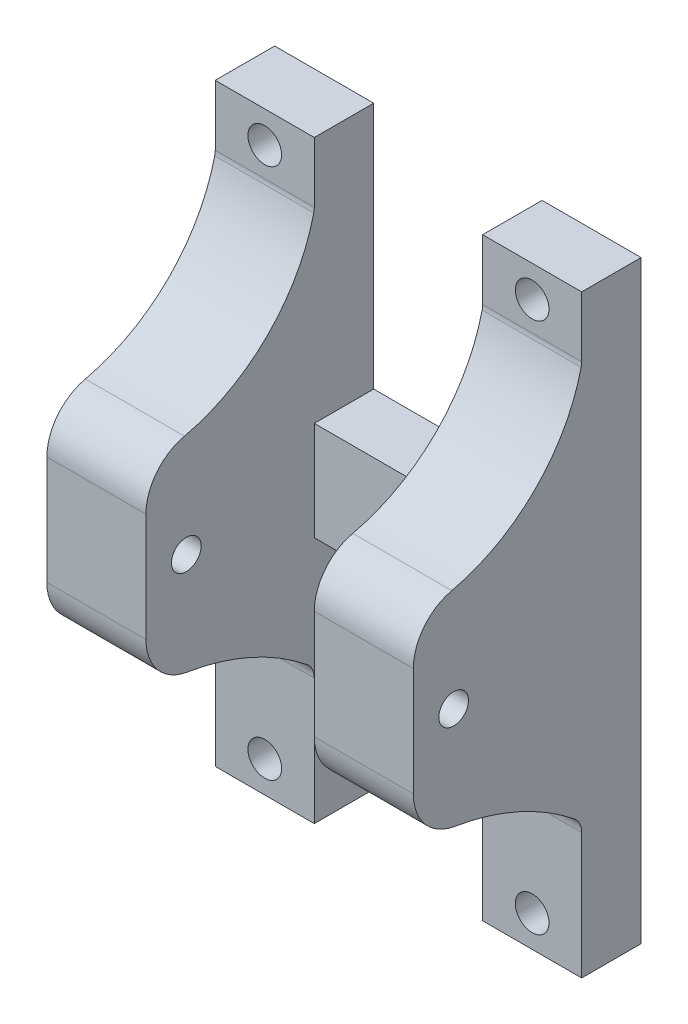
ISO-10303-21;
HEADER;
FILE_DESCRIPTION(('STEP AP214'),'2;1');
FILE_NAME('part.step','',(''),(''),'','','');
FILE_SCHEMA(('AUTOMOTIVE_DESIGN { 1 0 10303 214 1 1 1 1 }'));
ENDSEC;
DATA;
#1=APPLICATION_CONTEXT('core data for automotive mechanical design processes');
#2=APPLICATION_PROTOCOL_DEFINITION('international standard','automotive_design',2000,#1);
#3=PRODUCT_CONTEXT('',#1,'mechanical');
#4=PRODUCT('Part','Part','',(#3));
#5=PRODUCT_RELATED_PRODUCT_CATEGORY('part','',(#4));
#6=PRODUCT_DEFINITION_FORMATION('','',#4);
#7=PRODUCT_DEFINITION_CONTEXT('part definition',#1,'design');
#8=PRODUCT_DEFINITION('design','',#6,#7);
#9=PRODUCT_DEFINITION_SHAPE('','',#8);
#10=(LENGTH_UNIT() NAMED_UNIT(*) SI_UNIT(.MILLI.,.METRE.));
#11=(NAMED_UNIT(*) PLANE_ANGLE_UNIT() SI_UNIT($,.RADIAN.));
#12=(NAMED_UNIT(*) SI_UNIT($,.STERADIAN.) SOLID_ANGLE_UNIT());
#13=UNCERTAINTY_MEASURE_WITH_UNIT(LENGTH_MEASURE(1.E-05),#10,'distance_accuracy_value','');
#14=(GEOMETRIC_REPRESENTATION_CONTEXT(3) GLOBAL_UNCERTAINTY_ASSIGNED_CONTEXT((#13)) GLOBAL_UNIT_ASSIGNED_CONTEXT((#10,
#11,#12)) REPRESENTATION_CONTEXT('',''));
#15=CARTESIAN_POINT('',(0.,0.,0.));
#16=DIRECTION('',(0.,0.,1.));
#17=DIRECTION('',(1.,0.,0.));
#18=AXIS2_PLACEMENT_3D('',#15,#16,#17);
#19=CARTESIAN_POINT('',(0.,0.,6.));
#20=DIRECTION('',(0.,0.,1.));
#21=DIRECTION('',(1.,0.,0.));
#22=AXIS2_PLACEMENT_3D('',#19,#20,#21);
#23=PLANE('',#22);
#24=CARTESIAN_POINT('',(13.5,26.8316167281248,6.));
#25=DIRECTION('',(0.,0.,-1.));
#26=DIRECTION('',(-1.,0.,0.));
#27=AXIS2_PLACEMENT_3D('',#24,#25,#26);
#28=CIRCLE('',#27,1.7);
#29=CARTESIAN_POINT('',(11.8,26.8316167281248,6.));
#30=VERTEX_POINT('',#29);
#31=EDGE_CURVE('E270',#30,#30,#28,.T.);
#32=ORIENTED_EDGE('',*,*,#31,.T.);
#33=EDGE_LOOP('',(#32));
#34=FACE_BOUND('',#33,.T.);
#35=DIRECTION('',(0.,-1.,0.));
#36=VECTOR('',#35,1.);
#37=CARTESIAN_POINT('',(8.50000000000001,30.,6.));
#38=LINE('',#37,#36);
#39=CARTESIAN_POINT('',(8.50000000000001,30.,6.));
#40=VERTEX_POINT('',#39);
#41=CARTESIAN_POINT('',(8.50000000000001,23.8875951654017,6.));
#42=VERTEX_POINT('',#41);
#43=EDGE_CURVE('E229',#40,#42,#38,.T.);
#44=ORIENTED_EDGE('',*,*,#43,.T.);
#45=DIRECTION('',(1.,0.,0.));
#46=VECTOR('',#45,1.);
#47=CARTESIAN_POINT('',(0.,23.8875951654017,6.));
#48=LINE('',#47,#46);
#49=CARTESIAN_POINT('',(18.5,23.8875951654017,6.));
#50=VERTEX_POINT('',#49);
#51=EDGE_CURVE('E441',#42,#50,#48,.T.);
#52=ORIENTED_EDGE('',*,*,#51,.T.);
#53=DIRECTION('',(0.,1.,0.));
#54=VECTOR('',#53,1.);
#55=CARTESIAN_POINT('',(18.5,30.,6.));
#56=LINE('',#55,#54);
#57=CARTESIAN_POINT('',(18.5,30.,6.));
#58=VERTEX_POINT('',#57);
#59=EDGE_CURVE('E319',#50,#58,#56,.T.);
#60=ORIENTED_EDGE('',*,*,#59,.T.);
#61=DIRECTION('',(-1.,0.,0.));
#62=VECTOR('',#61,1.);
#63=CARTESIAN_POINT('',(8.50000000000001,30.,6.));
#64=LINE('',#63,#62);
#65=EDGE_CURVE('E323',#58,#40,#64,.T.);
#66=ORIENTED_EDGE('',*,*,#65,.T.);
#67=EDGE_LOOP('',(#44,#52,#60,#66));
#68=FACE_BOUND('',#67,.T.);
#69=ADVANCED_FACE('F33',(#34,#68),#23,.T.);
#70=CARTESIAN_POINT('',(13.5,-26.8316167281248,6.));
#71=DIRECTION('',(0.,0.,1.));
#72=DIRECTION('',(-1.,0.,0.));
#73=AXIS2_PLACEMENT_3D('',#70,#71,#72);
#74=CIRCLE('',#73,1.7);
#75=CARTESIAN_POINT('',(11.8,-26.8316167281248,6.));
#76=VERTEX_POINT('',#75);
#77=EDGE_CURVE('E247',#76,#76,#74,.T.);
#78=ORIENTED_EDGE('',*,*,#77,.F.);
#79=EDGE_LOOP('',(#78));
#80=FACE_BOUND('',#79,.T.);
#81=CARTESIAN_POINT('',(18.5,-30.,6.));
#82=VERTEX_POINT('',#81);
#83=CARTESIAN_POINT('',(18.5,-17.2729413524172,6.));
#84=VERTEX_POINT('',#83);
#85=EDGE_CURVE('E320',#82,#84,#56,.T.);
#86=ORIENTED_EDGE('',*,*,#85,.T.);
#87=DIRECTION('',(1.,0.,0.));
#88=VECTOR('',#87,1.);
#89=CARTESIAN_POINT('',(0.,-17.2729413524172,6.));
#90=LINE('',#89,#88);
#91=CARTESIAN_POINT('',(8.50000000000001,-17.2729413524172,6.));
#92=VERTEX_POINT('',#91);
#93=EDGE_CURVE('E429',#84,#92,#90,.F.);
#94=ORIENTED_EDGE('',*,*,#93,.T.);
#95=DIRECTION('',(0.,-1.,0.));
#96=VECTOR('',#95,1.);
#97=CARTESIAN_POINT('',(8.50000000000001,-5.,6.));
#98=LINE('',#97,#96);
#99=CARTESIAN_POINT('',(8.50000000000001,-30.,6.));
#100=VERTEX_POINT('',#99);
#101=EDGE_CURVE('E315',#92,#100,#98,.T.);
#102=ORIENTED_EDGE('',*,*,#101,.T.);
#103=DIRECTION('',(1.,0.,0.));
#104=VECTOR('',#103,1.);
#105=CARTESIAN_POINT('',(8.50000000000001,-30.,6.));
#106=LINE('',#105,#104);
#107=EDGE_CURVE('E317',#100,#82,#106,.T.);
#108=ORIENTED_EDGE('',*,*,#107,.T.);
#109=EDGE_LOOP('',(#86,#94,#102,#108));
#110=FACE_BOUND('',#109,.T.);
#111=ADVANCED_FACE('F534',(#80,#110),#23,.T.);
#112=DIRECTION('',(0.,-1.,0.));
#113=VECTOR('',#112,1.);
#114=CARTESIAN_POINT('',(8.50000000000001,23.6632334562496,6.));
#115=LINE('',#114,#113);
#116=CARTESIAN_POINT('',(8.50000000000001,5.,6.));
#117=VERTEX_POINT('',#116);
#118=CARTESIAN_POINT('',(8.50000000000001,-5.,6.));
#119=VERTEX_POINT('',#118);
#120=EDGE_CURVE('E237',#117,#119,#115,.T.);
#121=ORIENTED_EDGE('',*,*,#120,.F.);
#122=DIRECTION('',(-1.,0.,0.));
#123=VECTOR('',#122,1.);
#124=CARTESIAN_POINT('',(-8.50000000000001,5.,6.));
#125=LINE('',#124,#123);
#126=CARTESIAN_POINT('',(-8.50000000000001,5.,6.));
#127=VERTEX_POINT('',#126);
#128=EDGE_CURVE('E219',#117,#127,#125,.T.);
#129=ORIENTED_EDGE('',*,*,#128,.T.);
#130=DIRECTION('',(0.,-1.,0.));
#131=VECTOR('',#130,1.);
#132=CARTESIAN_POINT('',(-8.50000000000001,23.6632334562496,6.));
#133=LINE('',#132,#131);
#134=CARTESIAN_POINT('',(-8.50000000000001,-5.,6.));
#135=VERTEX_POINT('',#134);
#136=EDGE_CURVE('E290',#127,#135,#133,.T.);
#137=ORIENTED_EDGE('',*,*,#136,.T.);
#138=DIRECTION('',(1.,0.,0.));
#139=VECTOR('',#138,1.);
#140=CARTESIAN_POINT('',(-8.50000000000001,-5.,6.));
#141=LINE('',#140,#139);
#142=EDGE_CURVE('E245',#135,#119,#141,.T.);
#143=ORIENTED_EDGE('',*,*,#142,.T.);
#144=EDGE_LOOP('',(#121,#129,#137,#143));
#145=FACE_BOUND('',#144,.T.);
#146=ADVANCED_FACE('F243',(#145),#23,.T.);
#147=CARTESIAN_POINT('',(-13.5,-26.8316167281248,6.));
#148=DIRECTION('',(0.,0.,-1.));
#149=DIRECTION('',(1.,0.,0.));
#150=AXIS2_PLACEMENT_3D('',#147,#148,#149);
#151=CIRCLE('',#150,1.7);
#152=CARTESIAN_POINT('',(-11.8,-26.8316167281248,6.));
#153=VERTEX_POINT('',#152);
#154=EDGE_CURVE('E266',#153,#153,#151,.T.);
#155=ORIENTED_EDGE('',*,*,#154,.T.);
#156=EDGE_LOOP('',(#155));
#157=FACE_BOUND('',#156,.T.);
#158=DIRECTION('',(0.,1.,0.));
#159=VECTOR('',#158,1.);
#160=CARTESIAN_POINT('',(-8.50000000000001,-5.,6.));
#161=LINE('',#160,#159);
#162=CARTESIAN_POINT('',(-8.50000000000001,-30.,6.));
#163=VERTEX_POINT('',#162);
#164=CARTESIAN_POINT('',(-8.50000000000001,-17.2729413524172,6.));
#165=VERTEX_POINT('',#164);
#166=EDGE_CURVE('E311',#163,#165,#161,.T.);
#167=ORIENTED_EDGE('',*,*,#166,.T.);
#168=DIRECTION('',(1.,0.,0.));
#169=VECTOR('',#168,1.);
#170=CARTESIAN_POINT('',(-18.5,-17.2729413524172,6.));
#171=LINE('',#170,#169);
#172=CARTESIAN_POINT('',(-18.5,-17.2729413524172,6.));
#173=VERTEX_POINT('',#172);
#174=EDGE_CURVE('E431',#165,#173,#171,.F.);
#175=ORIENTED_EDGE('',*,*,#174,.T.);
#176=DIRECTION('',(0.,-1.,0.));
#177=VECTOR('',#176,1.);
#178=CARTESIAN_POINT('',(-18.5,30.,6.));
#179=LINE('',#178,#177);
#180=CARTESIAN_POINT('',(-18.5,-30.,6.));
#181=VERTEX_POINT('',#180);
#182=EDGE_CURVE('E309',#173,#181,#179,.T.);
#183=ORIENTED_EDGE('',*,*,#182,.T.);
#184=DIRECTION('',(1.,0.,0.));
#185=VECTOR('',#184,1.);
#186=CARTESIAN_POINT('',(-18.5,-30.,6.));
#187=LINE('',#186,#185);
#188=EDGE_CURVE('E308',#181,#163,#187,.T.);
#189=ORIENTED_EDGE('',*,*,#188,.T.);
#190=EDGE_LOOP('',(#167,#175,#183,#189));
#191=FACE_BOUND('',#190,.T.);
#192=ADVANCED_FACE('F497',(#157,#191),#23,.T.);
#193=CARTESIAN_POINT('',(-18.5,30.,6.));
#194=DIRECTION('',(1.,0.,0.));
#195=DIRECTION('',(0.,1.,0.));
#196=AXIS2_PLACEMENT_3D('',#193,#194,#195);
#197=PLANE('',#196);
#198=DIRECTION('',(0.,1.,0.));
#199=VECTOR('',#198,1.);
#200=CARTESIAN_POINT('',(-18.5,10.,23.));
#201=LINE('',#200,#199);
#202=CARTESIAN_POINT('',(-18.5,-5.40625723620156,23.));
#203=VERTEX_POINT('',#202);
#204=CARTESIAN_POINT('',(-18.5,5.56497282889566,23.));
#205=VERTEX_POINT('',#204);
#206=EDGE_CURVE('E289',#203,#205,#201,.T.);
#207=ORIENTED_EDGE('',*,*,#206,.T.);
#208=CARTESIAN_POINT('',(-18.5,5.56497282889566,18.));
#209=DIRECTION('',(1.,0.,0.));
#210=DIRECTION('',(0.,1.,0.));
#211=AXIS2_PLACEMENT_3D('',#208,#209,#210);
#212=CIRCLE('',#211,5.);
#213=CARTESIAN_POINT('',(-18.5,10.4389047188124,19.1157006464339));
#214=VERTEX_POINT('',#213);
#215=EDGE_CURVE('E411',#205,#214,#212,.F.);
#216=ORIENTED_EDGE('',*,*,#215,.T.);
#217=CARTESIAN_POINT('',(-18.5,27.4074442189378,23.));
#218=DIRECTION('',(1.,0.,0.));
#219=DIRECTION('',(0.,1.,0.));
#220=AXIS2_PLACEMENT_3D('',#217,#218,#219);
#221=CIRCLE('',#220,17.4074442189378);
#222=CARTESIAN_POINT('',(-18.5,23.4306927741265,6.05288926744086));
#223=VERTEX_POINT('',#222);
#224=EDGE_CURVE('E281',#214,#223,#221,.T.);
#225=ORIENTED_EDGE('',*,*,#224,.T.);
#226=CARTESIAN_POINT('',(-18.5,23.8875951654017,8.));
#227=DIRECTION('',(1.,0.,0.));
#228=DIRECTION('',(0.,1.,0.));
#229=AXIS2_PLACEMENT_3D('',#226,#227,#228);
#230=CIRCLE('',#229,2.);
#231=CARTESIAN_POINT('',(-18.5,23.8875951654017,6.));
#232=VERTEX_POINT('',#231);
#233=EDGE_CURVE('E453',#223,#232,#230,.T.);
#234=ORIENTED_EDGE('',*,*,#233,.T.);
#235=CARTESIAN_POINT('',(-18.5,30.,6.));
#236=VERTEX_POINT('',#235);
#237=EDGE_CURVE('E305',#236,#232,#179,.T.);
#238=ORIENTED_EDGE('',*,*,#237,.F.);
#239=DIRECTION('',(0.,0.,-1.));
#240=VECTOR('',#239,1.);
#241=CARTESIAN_POINT('',(-18.5,30.,6.));
#242=LINE('',#241,#240);
#243=CARTESIAN_POINT('',(-18.5,30.,0.));
#244=VERTEX_POINT('',#243);
#245=EDGE_CURVE('E330',#236,#244,#242,.T.);
#246=ORIENTED_EDGE('',*,*,#245,.T.);
#247=DIRECTION('',(0.,-1.,0.));
#248=VECTOR('',#247,1.);
#249=CARTESIAN_POINT('',(-18.5,30.,0.));
#250=LINE('',#249,#248);
#251=CARTESIAN_POINT('',(-18.5,-30.,0.));
#252=VERTEX_POINT('',#251);
#253=EDGE_CURVE('E298',#244,#252,#250,.T.);
#254=ORIENTED_EDGE('',*,*,#253,.T.);
#255=DIRECTION('',(0.,0.,-1.));
#256=VECTOR('',#255,1.);
#257=CARTESIAN_POINT('',(-18.5,-30.,6.));
#258=LINE('',#257,#256);
#259=EDGE_CURVE('E293',#181,#252,#258,.T.);
#260=ORIENTED_EDGE('',*,*,#259,.F.);
#261=ORIENTED_EDGE('',*,*,#182,.F.);
#262=CARTESIAN_POINT('',(-18.5,-17.2729413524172,8.));
#263=DIRECTION('',(1.,0.,0.));
#264=DIRECTION('',(0.,1.,0.));
#265=AXIS2_PLACEMENT_3D('',#262,#263,#264);
#266=CIRCLE('',#265,2.);
#267=CARTESIAN_POINT('',(-18.5,-15.7128698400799,6.74853011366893));
#268=VERTEX_POINT('',#267);
#269=EDGE_CURVE('E449',#173,#268,#266,.T.);
#270=ORIENTED_EDGE('',*,*,#269,.T.);
#271=CARTESIAN_POINT('',(-18.5,-35.9718113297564,23.));
#272=DIRECTION('',(1.,0.,0.));
#273=DIRECTION('',(0.,-1.,0.));
#274=AXIS2_PLACEMENT_3D('',#271,#272,#273);
#275=CIRCLE('',#274,25.9718113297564);
#276=CARTESIAN_POINT('',(-18.5,-10.340672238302,18.8071855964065));
#277=VERTEX_POINT('',#276);
#278=EDGE_CURVE('E301',#268,#277,#275,.T.);
#279=ORIENTED_EDGE('',*,*,#278,.T.);
#280=CARTESIAN_POINT('',(-18.5,-5.40625723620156,18.));
#281=DIRECTION('',(1.,0.,0.));
#282=DIRECTION('',(0.,1.,0.));
#283=AXIS2_PLACEMENT_3D('',#280,#281,#282);
#284=CIRCLE('',#283,5.);
#285=EDGE_CURVE('E409',#277,#203,#284,.F.);
#286=ORIENTED_EDGE('',*,*,#285,.T.);
#287=EDGE_LOOP('',(#207,#216,#225,#234,#238,#246,#254,#260,#261,#270,#279,#286));
#288=FACE_BOUND('',#287,.T.);
#289=CARTESIAN_POINT('',(-18.5,0.,18.9261868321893));
#290=DIRECTION('',(-1.,0.,0.));
#291=DIRECTION('',(0.,-1.,0.));
#292=AXIS2_PLACEMENT_3D('',#289,#290,#291);
#293=CIRCLE('',#292,1.5);
#294=CARTESIAN_POINT('',(-18.5,-1.50000000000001,18.9261868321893));
#295=VERTEX_POINT('',#294);
#296=EDGE_CURVE('E282',#295,#295,#293,.T.);
#297=ORIENTED_EDGE('',*,*,#296,.F.);
#298=EDGE_LOOP('',(#297));
#299=FACE_BOUND('',#298,.T.);
#300=ADVANCED_FACE('F474',(#288,#299),#197,.F.);
#301=CARTESIAN_POINT('',(-18.5,-30.,6.));
#302=DIRECTION('',(0.,1.,0.));
#303=DIRECTION('',(0.,0.,1.));
#304=AXIS2_PLACEMENT_3D('',#301,#302,#303);
#305=PLANE('',#304);
#306=DIRECTION('',(1.,0.,0.));
#307=VECTOR('',#306,1.);
#308=CARTESIAN_POINT('',(-18.5,-30.,0.));
#309=LINE('',#308,#307);
#310=CARTESIAN_POINT('',(-8.50000000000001,-30.,0.));
#311=VERTEX_POINT('',#310);
#312=EDGE_CURVE('E333',#252,#311,#309,.T.);
#313=ORIENTED_EDGE('',*,*,#312,.T.);
#314=DIRECTION('',(0.,0.,-1.));
#315=VECTOR('',#314,1.);
#316=CARTESIAN_POINT('',(-8.50000000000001,-30.,6.));
#317=LINE('',#316,#315);
#318=EDGE_CURVE('E375',#163,#311,#317,.T.);
#319=ORIENTED_EDGE('',*,*,#318,.F.);
#320=ORIENTED_EDGE('',*,*,#188,.F.);
#321=ORIENTED_EDGE('',*,*,#259,.T.);
#322=EDGE_LOOP('',(#313,#319,#320,#321));
#323=FACE_BOUND('',#322,.T.);
#324=ADVANCED_FACE('F493',(#323),#305,.F.);
#325=CARTESIAN_POINT('',(-8.50000000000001,-5.,6.));
#326=DIRECTION('',(0.,1.,0.));
#327=DIRECTION('',(0.,0.,1.));
#328=AXIS2_PLACEMENT_3D('',#325,#326,#327);
#329=PLANE('',#328);
#330=DIRECTION('',(1.,0.,0.));
#331=VECTOR('',#330,1.);
#332=CARTESIAN_POINT('',(-8.50000000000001,-5.,0.));
#333=LINE('',#332,#331);
#334=CARTESIAN_POINT('',(-8.50000000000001,-5.,0.));
#335=VERTEX_POINT('',#334);
#336=CARTESIAN_POINT('',(8.50000000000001,-5.,0.));
#337=VERTEX_POINT('',#336);
#338=EDGE_CURVE('E337',#335,#337,#333,.T.);
#339=ORIENTED_EDGE('',*,*,#338,.T.);
#340=DIRECTION('',(0.,0.,-1.));
#341=VECTOR('',#340,1.);
#342=CARTESIAN_POINT('',(8.50000000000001,-5.,6.));
#343=LINE('',#342,#341);
#344=EDGE_CURVE('E370',#119,#337,#343,.T.);
#345=ORIENTED_EDGE('',*,*,#344,.F.);
#346=ORIENTED_EDGE('',*,*,#142,.F.);
#347=DIRECTION('',(0.,0.,-1.));
#348=VECTOR('',#347,1.);
#349=CARTESIAN_POINT('',(-8.50000000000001,-5.,6.));
#350=LINE('',#349,#348);
#351=EDGE_CURVE('E372',#135,#335,#350,.T.);
#352=ORIENTED_EDGE('',*,*,#351,.T.);
#353=EDGE_LOOP('',(#339,#345,#346,#352));
#354=FACE_BOUND('',#353,.T.);
#355=ADVANCED_FACE('F663',(#354),#329,.F.);
#356=CARTESIAN_POINT('',(8.50000000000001,-30.,6.));
#357=DIRECTION('',(0.,1.,0.));
#358=DIRECTION('',(0.,0.,1.));
#359=AXIS2_PLACEMENT_3D('',#356,#357,#358);
#360=PLANE('',#359);
#361=DIRECTION('',(1.,0.,0.));
#362=VECTOR('',#361,1.);
#363=CARTESIAN_POINT('',(8.50000000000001,-30.,0.));
#364=LINE('',#363,#362);
#365=CARTESIAN_POINT('',(8.50000000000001,-30.,0.));
#366=VERTEX_POINT('',#365);
#367=CARTESIAN_POINT('',(18.5,-30.,0.));
#368=VERTEX_POINT('',#367);
#369=EDGE_CURVE('E341',#366,#368,#364,.T.);
#370=ORIENTED_EDGE('',*,*,#369,.T.);
#371=DIRECTION('',(0.,0.,-1.));
#372=VECTOR('',#371,1.);
#373=CARTESIAN_POINT('',(18.5,-30.,6.));
#374=LINE('',#373,#372);
#375=EDGE_CURVE('E364',#82,#368,#374,.T.);
#376=ORIENTED_EDGE('',*,*,#375,.F.);
#377=ORIENTED_EDGE('',*,*,#107,.F.);
#378=DIRECTION('',(0.,0.,-1.));
#379=VECTOR('',#378,1.);
#380=CARTESIAN_POINT('',(8.50000000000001,-30.,6.));
#381=LINE('',#380,#379);
#382=EDGE_CURVE('E367',#100,#366,#381,.T.);
#383=ORIENTED_EDGE('',*,*,#382,.T.);
#384=EDGE_LOOP('',(#370,#376,#377,#383));
#385=FACE_BOUND('',#384,.T.);
#386=ADVANCED_FACE('F667',(#385),#360,.F.);
#387=CARTESIAN_POINT('',(18.5,30.,6.));
#388=DIRECTION('',(-1.,0.,0.));
#389=DIRECTION('',(0.,-1.,0.));
#390=AXIS2_PLACEMENT_3D('',#387,#388,#389);
#391=PLANE('',#390);
#392=CARTESIAN_POINT('',(18.5,27.4074442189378,23.));
#393=DIRECTION('',(1.,0.,0.));
#394=DIRECTION('',(0.,1.,0.));
#395=AXIS2_PLACEMENT_3D('',#392,#393,#394);
#396=CIRCLE('',#395,17.4074442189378);
#397=CARTESIAN_POINT('',(18.5,10.4389047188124,19.1157006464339));
#398=VERTEX_POINT('',#397);
#399=CARTESIAN_POINT('',(18.5,23.4306927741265,6.05288926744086));
#400=VERTEX_POINT('',#399);
#401=EDGE_CURVE('E257',#398,#400,#396,.T.);
#402=ORIENTED_EDGE('',*,*,#401,.F.);
#403=CARTESIAN_POINT('',(18.5,5.56497282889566,18.));
#404=DIRECTION('',(-1.,0.,0.));
#405=DIRECTION('',(0.,-1.,0.));
#406=AXIS2_PLACEMENT_3D('',#403,#404,#405);
#407=CIRCLE('',#406,5.);
#408=CARTESIAN_POINT('',(18.5,5.56497282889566,23.));
#409=VERTEX_POINT('',#408);
#410=EDGE_CURVE('E393',#398,#409,#407,.F.);
#411=ORIENTED_EDGE('',*,*,#410,.T.);
#412=DIRECTION('',(0.,1.,0.));
#413=VECTOR('',#412,1.);
#414=CARTESIAN_POINT('',(18.5,10.,23.));
#415=LINE('',#414,#413);
#416=CARTESIAN_POINT('',(18.5,-5.40625723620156,23.));
#417=VERTEX_POINT('',#416);
#418=EDGE_CURVE('E259',#417,#409,#415,.T.);
#419=ORIENTED_EDGE('',*,*,#418,.F.);
#420=CARTESIAN_POINT('',(18.5,-5.40625723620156,18.));
#421=DIRECTION('',(-1.,0.,0.));
#422=DIRECTION('',(0.,-1.,0.));
#423=AXIS2_PLACEMENT_3D('',#420,#421,#422);
#424=CIRCLE('',#423,5.);
#425=CARTESIAN_POINT('',(18.5,-10.340672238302,18.8071855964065));
#426=VERTEX_POINT('',#425);
#427=EDGE_CURVE('E390',#417,#426,#424,.F.);
#428=ORIENTED_EDGE('',*,*,#427,.T.);
#429=CARTESIAN_POINT('',(18.5,-35.9718113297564,23.));
#430=DIRECTION('',(1.,0.,0.));
#431=DIRECTION('',(0.,-1.,0.));
#432=AXIS2_PLACEMENT_3D('',#429,#430,#431);
#433=CIRCLE('',#432,25.9718113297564);
#434=CARTESIAN_POINT('',(18.5,-15.7128698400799,6.74853011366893));
#435=VERTEX_POINT('',#434);
#436=EDGE_CURVE('E263',#435,#426,#433,.T.);
#437=ORIENTED_EDGE('',*,*,#436,.F.);
#438=CARTESIAN_POINT('',(18.5,-17.2729413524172,8.));
#439=DIRECTION('',(-1.,0.,0.));
#440=DIRECTION('',(0.,-1.,0.));
#441=AXIS2_PLACEMENT_3D('',#438,#439,#440);
#442=CIRCLE('',#441,2.);
#443=EDGE_CURVE('E445',#435,#84,#442,.T.);
#444=ORIENTED_EDGE('',*,*,#443,.T.);
#445=ORIENTED_EDGE('',*,*,#85,.F.);
#446=ORIENTED_EDGE('',*,*,#375,.T.);
#447=DIRECTION('',(0.,1.,0.));
#448=VECTOR('',#447,1.);
#449=CARTESIAN_POINT('',(18.5,30.,0.));
#450=LINE('',#449,#448);
#451=CARTESIAN_POINT('',(18.5,30.,0.));
#452=VERTEX_POINT('',#451);
#453=EDGE_CURVE('E343',#368,#452,#450,.T.);
#454=ORIENTED_EDGE('',*,*,#453,.T.);
#455=DIRECTION('',(0.,0.,-1.));
#456=VECTOR('',#455,1.);
#457=CARTESIAN_POINT('',(18.5,30.,6.));
#458=LINE('',#457,#456);
#459=EDGE_CURVE('E361',#58,#452,#458,.T.);
#460=ORIENTED_EDGE('',*,*,#459,.F.);
#461=ORIENTED_EDGE('',*,*,#59,.F.);
#462=CARTESIAN_POINT('',(18.5,23.8875951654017,8.));
#463=DIRECTION('',(-1.,0.,0.));
#464=DIRECTION('',(0.,-1.,0.));
#465=AXIS2_PLACEMENT_3D('',#462,#463,#464);
#466=CIRCLE('',#465,2.);
#467=EDGE_CURVE('E41',#50,#400,#466,.T.);
#468=ORIENTED_EDGE('',*,*,#467,.T.);
#469=EDGE_LOOP('',(#402,#411,#419,#428,#437,#444,#445,#446,#454,#460,#461,#468));
#470=FACE_BOUND('',#469,.T.);
#471=CARTESIAN_POINT('',(18.5,0.,18.9261868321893));
#472=DIRECTION('',(-1.,0.,0.));
#473=DIRECTION('',(0.,-1.,0.));
#474=AXIS2_PLACEMENT_3D('',#471,#472,#473);
#475=CIRCLE('',#474,1.5);
#476=CARTESIAN_POINT('',(18.5,-1.50000000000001,18.9261868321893));
#477=VERTEX_POINT('',#476);
#478=EDGE_CURVE('E857',#477,#477,#475,.T.);
#479=ORIENTED_EDGE('',*,*,#478,.T.);
#480=EDGE_LOOP('',(#479));
#481=FACE_BOUND('',#480,.T.);
#482=ADVANCED_FACE('F740',(#470,#481),#391,.F.);
#483=CARTESIAN_POINT('',(8.50000000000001,30.,6.));
#484=DIRECTION('',(0.,-1.,0.));
#485=DIRECTION('',(1.,0.,0.));
#486=AXIS2_PLACEMENT_3D('',#483,#484,#485);
#487=PLANE('',#486);
#488=DIRECTION('',(-1.,0.,0.));
#489=VECTOR('',#488,1.);
#490=CARTESIAN_POINT('',(8.50000000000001,30.,0.));
#491=LINE('',#490,#489);
#492=CARTESIAN_POINT('',(8.50000000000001,30.,0.));
#493=VERTEX_POINT('',#492);
#494=EDGE_CURVE('E345',#452,#493,#491,.T.);
#495=ORIENTED_EDGE('',*,*,#494,.T.);
#496=DIRECTION('',(0.,0.,-1.));
#497=VECTOR('',#496,1.);
#498=CARTESIAN_POINT('',(8.50000000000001,30.,6.));
#499=LINE('',#498,#497);
#500=EDGE_CURVE('E241',#40,#493,#499,.T.);
#501=ORIENTED_EDGE('',*,*,#500,.F.);
#502=ORIENTED_EDGE('',*,*,#65,.F.);
#503=ORIENTED_EDGE('',*,*,#459,.T.);
#504=EDGE_LOOP('',(#495,#501,#502,#503));
#505=FACE_BOUND('',#504,.T.);
#506=ADVANCED_FACE('F745',(#505),#487,.F.);
#507=CARTESIAN_POINT('',(8.50000000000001,30.,6.));
#508=DIRECTION('',(1.,0.,0.));
#509=DIRECTION('',(0.,1.,0.));
#510=AXIS2_PLACEMENT_3D('',#507,#508,#509);
#511=PLANE('',#510);
#512=DIRECTION('',(0.,1.,0.));
#513=VECTOR('',#512,1.);
#514=CARTESIAN_POINT('',(8.50000000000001,10.,23.));
#515=LINE('',#514,#513);
#516=CARTESIAN_POINT('',(8.50000000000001,-5.40625723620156,23.));
#517=VERTEX_POINT('',#516);
#518=CARTESIAN_POINT('',(8.50000000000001,5.56497282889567,23.));
#519=VERTEX_POINT('',#518);
#520=EDGE_CURVE('E253',#517,#519,#515,.T.);
#521=ORIENTED_EDGE('',*,*,#520,.T.);
#522=CARTESIAN_POINT('',(8.50000000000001,5.56497282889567,18.));
#523=DIRECTION('',(1.,0.,0.));
#524=DIRECTION('',(0.,1.,0.));
#525=AXIS2_PLACEMENT_3D('',#522,#523,#524);
#526=CIRCLE('',#525,5.);
#527=CARTESIAN_POINT('',(8.50000000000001,10.4389047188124,19.1157006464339));
#528=VERTEX_POINT('',#527);
#529=EDGE_CURVE('E402',#519,#528,#526,.F.);
#530=ORIENTED_EDGE('',*,*,#529,.T.);
#531=CARTESIAN_POINT('',(8.50000000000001,27.4074442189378,23.));
#532=DIRECTION('',(1.,0.,0.));
#533=DIRECTION('',(0.,1.,0.));
#534=AXIS2_PLACEMENT_3D('',#531,#532,#533);
#535=CIRCLE('',#534,17.4074442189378);
#536=CARTESIAN_POINT('',(8.50000000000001,23.4306927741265,6.05288926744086));
#537=VERTEX_POINT('',#536);
#538=EDGE_CURVE('E264',#528,#537,#535,.T.);
#539=ORIENTED_EDGE('',*,*,#538,.T.);
#540=CARTESIAN_POINT('',(8.50000000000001,23.8875951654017,8.));
#541=DIRECTION('',(1.,0.,0.));
#542=DIRECTION('',(0.,1.,0.));
#543=AXIS2_PLACEMENT_3D('',#540,#541,#542);
#544=CIRCLE('',#543,2.);
#545=EDGE_CURVE('E11',#537,#42,#544,.T.);
#546=ORIENTED_EDGE('',*,*,#545,.T.);
#547=ORIENTED_EDGE('',*,*,#43,.F.);
#548=ORIENTED_EDGE('',*,*,#500,.T.);
#549=DIRECTION('',(0.,-1.,0.));
#550=VECTOR('',#549,1.);
#551=CARTESIAN_POINT('',(8.50000000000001,30.,0.));
#552=LINE('',#551,#550);
#553=CARTESIAN_POINT('',(8.50000000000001,5.,0.));
#554=VERTEX_POINT('',#553);
#555=EDGE_CURVE('E240',#493,#554,#552,.T.);
#556=ORIENTED_EDGE('',*,*,#555,.T.);
#557=DIRECTION('',(0.,0.,-1.));
#558=VECTOR('',#557,1.);
#559=CARTESIAN_POINT('',(8.50000000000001,5.,6.));
#560=LINE('',#559,#558);
#561=EDGE_CURVE('E222',#117,#554,#560,.T.);
#562=ORIENTED_EDGE('',*,*,#561,.F.);
#563=ORIENTED_EDGE('',*,*,#120,.T.);
#564=ORIENTED_EDGE('',*,*,#344,.T.);
#565=DIRECTION('',(0.,-1.,0.));
#566=VECTOR('',#565,1.);
#567=CARTESIAN_POINT('',(8.50000000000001,-5.,0.));
#568=LINE('',#567,#566);
#569=EDGE_CURVE('E339',#337,#366,#568,.T.);
#570=ORIENTED_EDGE('',*,*,#569,.T.);
#571=ORIENTED_EDGE('',*,*,#382,.F.);
#572=ORIENTED_EDGE('',*,*,#101,.F.);
#573=CARTESIAN_POINT('',(8.50000000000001,-17.2729413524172,8.));
#574=DIRECTION('',(1.,0.,0.));
#575=DIRECTION('',(0.,1.,0.));
#576=AXIS2_PLACEMENT_3D('',#573,#574,#575);
#577=CIRCLE('',#576,2.);
#578=CARTESIAN_POINT('',(8.5,-15.7128698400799,6.74853011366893));
#579=VERTEX_POINT('',#578);
#580=EDGE_CURVE('E447',#92,#579,#577,.T.);
#581=ORIENTED_EDGE('',*,*,#580,.T.);
#582=CARTESIAN_POINT('',(8.5,-35.9718113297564,23.));
#583=DIRECTION('',(1.,0.,0.));
#584=DIRECTION('',(0.,-1.,0.));
#585=AXIS2_PLACEMENT_3D('',#582,#583,#584);
#586=CIRCLE('',#585,25.9718113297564);
#587=CARTESIAN_POINT('',(8.5,-10.340672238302,18.8071855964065));
#588=VERTEX_POINT('',#587);
#589=EDGE_CURVE('E248',#579,#588,#586,.T.);
#590=ORIENTED_EDGE('',*,*,#589,.T.);
#591=CARTESIAN_POINT('',(8.50000000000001,-5.40625723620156,18.));
#592=DIRECTION('',(1.,0.,0.));
#593=DIRECTION('',(0.,1.,0.));
#594=AXIS2_PLACEMENT_3D('',#591,#592,#593);
#595=CIRCLE('',#594,5.);
#596=EDGE_CURVE('E400',#588,#517,#595,.F.);
#597=ORIENTED_EDGE('',*,*,#596,.T.);
#598=EDGE_LOOP('',(#521,#530,#539,#546,#547,#548,#556,#562,#563,#564,#570,#571,#572,#581,#590,#597));
#599=FACE_BOUND('',#598,.T.);
#600=CARTESIAN_POINT('',(8.50000000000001,0.,18.9261868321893));
#601=DIRECTION('',(-1.,0.,0.));
#602=DIRECTION('',(0.,-1.,0.));
#603=AXIS2_PLACEMENT_3D('',#600,#601,#602);
#604=CIRCLE('',#603,1.5);
#605=CARTESIAN_POINT('',(8.50000000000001,-1.50000000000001,18.9261868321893));
#606=VERTEX_POINT('',#605);
#607=EDGE_CURVE('E260',#606,#606,#604,.T.);
#608=ORIENTED_EDGE('',*,*,#607,.F.);
#609=EDGE_LOOP('',(#608));
#610=FACE_BOUND('',#609,.T.);
#611=ADVANCED_FACE('F234',(#599,#610),#511,.F.);
#612=CARTESIAN_POINT('',(-8.50000000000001,5.,6.));
#613=DIRECTION('',(0.,-1.,0.));
#614=DIRECTION('',(0.,0.,-1.));
#615=AXIS2_PLACEMENT_3D('',#612,#613,#614);
#616=PLANE('',#615);
#617=DIRECTION('',(-1.,0.,0.));
#618=VECTOR('',#617,1.);
#619=CARTESIAN_POINT('',(-8.50000000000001,5.,0.));
#620=LINE('',#619,#618);
#621=CARTESIAN_POINT('',(-8.50000000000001,5.,0.));
#622=VERTEX_POINT('',#621);
#623=EDGE_CURVE('E348',#554,#622,#620,.T.);
#624=ORIENTED_EDGE('',*,*,#623,.T.);
#625=DIRECTION('',(0.,0.,-1.));
#626=VECTOR('',#625,1.);
#627=CARTESIAN_POINT('',(-8.50000000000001,5.,6.));
#628=LINE('',#627,#626);
#629=EDGE_CURVE('E225',#127,#622,#628,.T.);
#630=ORIENTED_EDGE('',*,*,#629,.F.);
#631=ORIENTED_EDGE('',*,*,#128,.F.);
#632=ORIENTED_EDGE('',*,*,#561,.T.);
#633=EDGE_LOOP('',(#624,#630,#631,#632));
#634=FACE_BOUND('',#633,.T.);
#635=ADVANCED_FACE('F221',(#634),#616,.F.);
#636=CARTESIAN_POINT('',(-8.50000000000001,30.,6.));
#637=DIRECTION('',(-1.,0.,0.));
#638=DIRECTION('',(0.,0.,1.));
#639=AXIS2_PLACEMENT_3D('',#636,#637,#638);
#640=PLANE('',#639);
#641=CARTESIAN_POINT('',(-8.50000000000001,27.4074442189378,23.));
#642=DIRECTION('',(1.,0.,0.));
#643=DIRECTION('',(0.,1.,0.));
#644=AXIS2_PLACEMENT_3D('',#641,#642,#643);
#645=CIRCLE('',#644,17.4074442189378);
#646=CARTESIAN_POINT('',(-8.50000000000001,10.4389047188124,19.1157006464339));
#647=VERTEX_POINT('',#646);
#648=CARTESIAN_POINT('',(-8.50000000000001,23.4306927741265,6.05288926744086));
#649=VERTEX_POINT('',#648);
#650=EDGE_CURVE('E285',#647,#649,#645,.T.);
#651=ORIENTED_EDGE('',*,*,#650,.F.);
#652=CARTESIAN_POINT('',(-8.50000000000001,5.56497282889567,18.));
#653=DIRECTION('',(-1.,0.,0.));
#654=DIRECTION('',(0.,0.,1.));
#655=AXIS2_PLACEMENT_3D('',#652,#653,#654);
#656=CIRCLE('',#655,5.);
#657=CARTESIAN_POINT('',(-8.50000000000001,5.56497282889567,23.));
#658=VERTEX_POINT('',#657);
#659=EDGE_CURVE('E418',#647,#658,#656,.F.);
#660=ORIENTED_EDGE('',*,*,#659,.T.);
#661=DIRECTION('',(0.,1.,0.));
#662=VECTOR('',#661,1.);
#663=CARTESIAN_POINT('',(-8.50000000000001,10.,23.));
#664=LINE('',#663,#662);
#665=CARTESIAN_POINT('',(-8.50000000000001,-5.40625723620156,23.));
#666=VERTEX_POINT('',#665);
#667=EDGE_CURVE('E295',#666,#658,#664,.T.);
#668=ORIENTED_EDGE('',*,*,#667,.F.);
#669=CARTESIAN_POINT('',(-8.50000000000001,-5.40625723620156,18.));
#670=DIRECTION('',(-1.,0.,0.));
#671=DIRECTION('',(0.,0.,1.));
#672=AXIS2_PLACEMENT_3D('',#669,#670,#671);
#673=CIRCLE('',#672,5.);
#674=CARTESIAN_POINT('',(-8.5,-10.340672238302,18.8071855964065));
#675=VERTEX_POINT('',#674);
#676=EDGE_CURVE('E415',#666,#675,#673,.F.);
#677=ORIENTED_EDGE('',*,*,#676,.T.);
#678=CARTESIAN_POINT('',(-8.5,-35.9718113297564,23.));
#679=DIRECTION('',(1.,0.,0.));
#680=DIRECTION('',(0.,-1.,0.));
#681=AXIS2_PLACEMENT_3D('',#678,#679,#680);
#682=CIRCLE('',#681,25.9718113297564);
#683=CARTESIAN_POINT('',(-8.5,-15.7128698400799,6.74853011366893));
#684=VERTEX_POINT('',#683);
#685=EDGE_CURVE('E288',#684,#675,#682,.T.);
#686=ORIENTED_EDGE('',*,*,#685,.F.);
#687=CARTESIAN_POINT('',(-8.50000000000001,-17.2729413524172,8.));
#688=DIRECTION('',(-1.,0.,0.));
#689=DIRECTION('',(0.,0.,1.));
#690=AXIS2_PLACEMENT_3D('',#687,#688,#689);
#691=CIRCLE('',#690,2.);
#692=EDGE_CURVE('E451',#684,#165,#691,.T.);
#693=ORIENTED_EDGE('',*,*,#692,.T.);
#694=ORIENTED_EDGE('',*,*,#166,.F.);
#695=ORIENTED_EDGE('',*,*,#318,.T.);
#696=DIRECTION('',(0.,1.,0.));
#697=VECTOR('',#696,1.);
#698=CARTESIAN_POINT('',(-8.50000000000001,-5.,0.));
#699=LINE('',#698,#697);
#700=EDGE_CURVE('E335',#311,#335,#699,.T.);
#701=ORIENTED_EDGE('',*,*,#700,.T.);
#702=ORIENTED_EDGE('',*,*,#351,.F.);
#703=ORIENTED_EDGE('',*,*,#136,.F.);
#704=ORIENTED_EDGE('',*,*,#629,.T.);
#705=DIRECTION('',(0.,1.,0.));
#706=VECTOR('',#705,1.);
#707=CARTESIAN_POINT('',(-8.50000000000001,30.,0.));
#708=LINE('',#707,#706);
#709=CARTESIAN_POINT('',(-8.50000000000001,30.,0.));
#710=VERTEX_POINT('',#709);
#711=EDGE_CURVE('E350',#622,#710,#708,.T.);
#712=ORIENTED_EDGE('',*,*,#711,.T.);
#713=DIRECTION('',(0.,0.,-1.));
#714=VECTOR('',#713,1.);
#715=CARTESIAN_POINT('',(-8.50000000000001,30.,6.));
#716=LINE('',#715,#714);
#717=CARTESIAN_POINT('',(-8.50000000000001,30.,6.));
#718=VERTEX_POINT('',#717);
#719=EDGE_CURVE('E356',#718,#710,#716,.T.);
#720=ORIENTED_EDGE('',*,*,#719,.F.);
#721=DIRECTION('',(0.,1.,0.));
#722=VECTOR('',#721,1.);
#723=CARTESIAN_POINT('',(-8.50000000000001,30.,6.));
#724=LINE('',#723,#722);
#725=CARTESIAN_POINT('',(-8.50000000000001,23.8875951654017,6.));
#726=VERTEX_POINT('',#725);
#727=EDGE_CURVE('E228',#726,#718,#724,.T.);
#728=ORIENTED_EDGE('',*,*,#727,.F.);
#729=CARTESIAN_POINT('',(-8.50000000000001,23.8875951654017,8.));
#730=DIRECTION('',(-1.,0.,0.));
#731=DIRECTION('',(0.,0.,1.));
#732=AXIS2_PLACEMENT_3D('',#729,#730,#731);
#733=CIRCLE('',#732,2.);
#734=EDGE_CURVE('E455',#726,#649,#733,.T.);
#735=ORIENTED_EDGE('',*,*,#734,.T.);
#736=EDGE_LOOP('',(#651,#660,#668,#677,#686,#693,#694,#695,#701,#702,#703,#704,#712,#720,#728,#735));
#737=FACE_BOUND('',#736,.T.);
#738=CARTESIAN_POINT('',(-8.50000000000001,0.,18.9261868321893));
#739=DIRECTION('',(-1.,0.,0.));
#740=DIRECTION('',(0.,-1.,0.));
#741=AXIS2_PLACEMENT_3D('',#738,#739,#740);
#742=CIRCLE('',#741,1.5);
#743=CARTESIAN_POINT('',(-8.50000000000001,-1.50000000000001,18.9261868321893));
#744=VERTEX_POINT('',#743);
#745=EDGE_CURVE('E278',#744,#744,#742,.T.);
#746=ORIENTED_EDGE('',*,*,#745,.T.);
#747=EDGE_LOOP('',(#746));
#748=FACE_BOUND('',#747,.T.);
#749=ADVANCED_FACE('F460',(#737,#748),#640,.F.);
#750=CARTESIAN_POINT('',(-18.5,30.,6.));
#751=DIRECTION('',(0.,-1.,0.));
#752=DIRECTION('',(1.,0.,0.));
#753=AXIS2_PLACEMENT_3D('',#750,#751,#752);
#754=PLANE('',#753);
#755=DIRECTION('',(-1.,0.,0.));
#756=VECTOR('',#755,1.);
#757=CARTESIAN_POINT('',(-18.5,30.,0.));
#758=LINE('',#757,#756);
#759=EDGE_CURVE('E352',#710,#244,#758,.T.);
#760=ORIENTED_EDGE('',*,*,#759,.T.);
#761=ORIENTED_EDGE('',*,*,#245,.F.);
#762=DIRECTION('',(-1.,0.,0.));
#763=VECTOR('',#762,1.);
#764=CARTESIAN_POINT('',(-18.5,30.,6.));
#765=LINE('',#764,#763);
#766=EDGE_CURVE('E328',#718,#236,#765,.T.);
#767=ORIENTED_EDGE('',*,*,#766,.F.);
#768=ORIENTED_EDGE('',*,*,#719,.T.);
#769=EDGE_LOOP('',(#760,#761,#767,#768));
#770=FACE_BOUND('',#769,.T.);
#771=ADVANCED_FACE('F481',(#770),#754,.F.);
#772=CARTESIAN_POINT('',(-13.5,26.8316167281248,6.));
#773=DIRECTION('',(0.,0.,1.));
#774=DIRECTION('',(1.,0.,0.));
#775=AXIS2_PLACEMENT_3D('',#772,#773,#774);
#776=CIRCLE('',#775,1.7);
#777=CARTESIAN_POINT('',(-11.8,26.8316167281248,6.));
#778=VERTEX_POINT('',#777);
#779=EDGE_CURVE('E274',#778,#778,#776,.T.);
#780=ORIENTED_EDGE('',*,*,#779,.F.);
#781=EDGE_LOOP('',(#780));
#782=FACE_BOUND('',#781,.T.);
#783=ORIENTED_EDGE('',*,*,#237,.T.);
#784=DIRECTION('',(1.,0.,0.));
#785=VECTOR('',#784,1.);
#786=CARTESIAN_POINT('',(-8.50000000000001,23.8875951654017,6.));
#787=LINE('',#786,#785);
#788=EDGE_CURVE('E439',#232,#726,#787,.T.);
#789=ORIENTED_EDGE('',*,*,#788,.T.);
#790=ORIENTED_EDGE('',*,*,#727,.T.);
#791=ORIENTED_EDGE('',*,*,#766,.T.);
#792=EDGE_LOOP('',(#783,#789,#790,#791));
#793=FACE_BOUND('',#792,.T.);
#794=ADVANCED_FACE('F477',(#782,#793),#23,.T.);
#795=CARTESIAN_POINT('',(0.,0.,0.));
#796=DIRECTION('',(0.,0.,1.));
#797=DIRECTION('',(1.,0.,0.));
#798=AXIS2_PLACEMENT_3D('',#795,#796,#797);
#799=PLANE('',#798);
#800=CARTESIAN_POINT('',(13.5,-26.8316167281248,0.));
#801=DIRECTION('',(0.,0.,1.));
#802=DIRECTION('',(1.,0.,0.));
#803=AXIS2_PLACEMENT_3D('',#800,#801,#802);
#804=CIRCLE('',#803,1.7);
#805=CARTESIAN_POINT('',(15.2,-26.8316167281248,0.));
#806=VERTEX_POINT('',#805);
#807=EDGE_CURVE('E251',#806,#806,#804,.T.);
#808=ORIENTED_EDGE('',*,*,#807,.T.);
#809=EDGE_LOOP('',(#808));
#810=FACE_BOUND('',#809,.T.);
#811=CARTESIAN_POINT('',(-13.5,-26.8316167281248,0.));
#812=DIRECTION('',(0.,0.,1.));
#813=DIRECTION('',(1.,0.,0.));
#814=AXIS2_PLACEMENT_3D('',#811,#812,#813);
#815=CIRCLE('',#814,1.7);
#816=CARTESIAN_POINT('',(-11.8,-26.8316167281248,0.));
#817=VERTEX_POINT('',#816);
#818=EDGE_CURVE('E269',#817,#817,#815,.F.);
#819=ORIENTED_EDGE('',*,*,#818,.F.);
#820=EDGE_LOOP('',(#819));
#821=FACE_BOUND('',#820,.T.);
#822=CARTESIAN_POINT('',(13.5,26.8316167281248,0.));
#823=DIRECTION('',(0.,0.,1.));
#824=DIRECTION('',(1.,0.,0.));
#825=AXIS2_PLACEMENT_3D('',#822,#823,#824);
#826=CIRCLE('',#825,1.7);
#827=CARTESIAN_POINT('',(15.2,26.8316167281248,0.));
#828=VERTEX_POINT('',#827);
#829=EDGE_CURVE('E273',#828,#828,#826,.F.);
#830=ORIENTED_EDGE('',*,*,#829,.F.);
#831=EDGE_LOOP('',(#830));
#832=FACE_BOUND('',#831,.T.);
#833=CARTESIAN_POINT('',(-13.5,26.8316167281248,0.));
#834=DIRECTION('',(0.,0.,1.));
#835=DIRECTION('',(1.,0.,0.));
#836=AXIS2_PLACEMENT_3D('',#833,#834,#835);
#837=CIRCLE('',#836,1.7);
#838=CARTESIAN_POINT('',(-11.8,26.8316167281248,0.));
#839=VERTEX_POINT('',#838);
#840=EDGE_CURVE('E277',#839,#839,#837,.T.);
#841=ORIENTED_EDGE('',*,*,#840,.T.);
#842=EDGE_LOOP('',(#841));
#843=FACE_BOUND('',#842,.T.);
#844=ORIENTED_EDGE('',*,*,#253,.F.);
#845=ORIENTED_EDGE('',*,*,#759,.F.);
#846=ORIENTED_EDGE('',*,*,#711,.F.);
#847=ORIENTED_EDGE('',*,*,#623,.F.);
#848=ORIENTED_EDGE('',*,*,#555,.F.);
#849=ORIENTED_EDGE('',*,*,#494,.F.);
#850=ORIENTED_EDGE('',*,*,#453,.F.);
#851=ORIENTED_EDGE('',*,*,#369,.F.);
#852=ORIENTED_EDGE('',*,*,#569,.F.);
#853=ORIENTED_EDGE('',*,*,#338,.F.);
#854=ORIENTED_EDGE('',*,*,#700,.F.);
#855=ORIENTED_EDGE('',*,*,#312,.F.);
#856=EDGE_LOOP('',(#844,#845,#846,#847,#848,#849,#850,#851,#852,#853,#854,#855));
#857=FACE_BOUND('',#856,.T.);
#858=ADVANCED_FACE('F486',(#810,#821,#832,#843,#857),#799,.F.);
#859=CARTESIAN_POINT('',(-8.50000000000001,27.4074442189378,23.));
#860=DIRECTION('',(-1.,0.,0.));
#861=DIRECTION('',(0.,-1.,0.));
#862=AXIS2_PLACEMENT_3D('',#859,#860,#861);
#863=CYLINDRICAL_SURFACE('',#862,17.4074442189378);
#864=ORIENTED_EDGE('',*,*,#650,.T.);
#865=DIRECTION('',(-1.,0.,0.));
#866=VECTOR('',#865,1.);
#867=CARTESIAN_POINT('',(-8.50000000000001,23.4306927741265,6.05288926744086));
#868=LINE('',#867,#866);
#869=EDGE_CURVE('E436',#649,#223,#868,.T.);
#870=ORIENTED_EDGE('',*,*,#869,.T.);
#871=ORIENTED_EDGE('',*,*,#224,.F.);
#872=DIRECTION('',(-1.,0.,0.));
#873=VECTOR('',#872,1.);
#874=CARTESIAN_POINT('',(-8.50000000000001,10.4389047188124,19.1157006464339));
#875=LINE('',#874,#873);
#876=EDGE_CURVE('E413',#214,#647,#875,.F.);
#877=ORIENTED_EDGE('',*,*,#876,.T.);
#878=EDGE_LOOP('',(#864,#870,#871,#877));
#879=FACE_BOUND('',#878,.T.);
#880=ADVANCED_FACE('F468',(#879),#863,.F.);
#881=CARTESIAN_POINT('',(-8.50000000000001,10.,23.));
#882=DIRECTION('',(0.,0.,1.));
#883=DIRECTION('',(1.,0.,0.));
#884=AXIS2_PLACEMENT_3D('',#881,#882,#883);
#885=PLANE('',#884);
#886=ORIENTED_EDGE('',*,*,#667,.T.);
#887=DIRECTION('',(-1.,0.,0.));
#888=VECTOR('',#887,1.);
#889=CARTESIAN_POINT('',(-8.50000000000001,5.56497282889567,23.));
#890=LINE('',#889,#888);
#891=EDGE_CURVE('E406',#658,#205,#890,.T.);
#892=ORIENTED_EDGE('',*,*,#891,.T.);
#893=ORIENTED_EDGE('',*,*,#206,.F.);
#894=DIRECTION('',(-1.,0.,0.));
#895=VECTOR('',#894,1.);
#896=CARTESIAN_POINT('',(-8.5,-5.40625723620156,23.));
#897=LINE('',#896,#895);
#898=EDGE_CURVE('E404',#203,#666,#897,.F.);
#899=ORIENTED_EDGE('',*,*,#898,.T.);
#900=EDGE_LOOP('',(#886,#892,#893,#899));
#901=FACE_BOUND('',#900,.T.);
#902=ADVANCED_FACE('F516',(#901),#885,.T.);
#903=CARTESIAN_POINT('',(-8.5,-35.9718113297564,23.));
#904=DIRECTION('',(-1.,0.,0.));
#905=DIRECTION('',(0.,-1.,0.));
#906=AXIS2_PLACEMENT_3D('',#903,#904,#905);
#907=CYLINDRICAL_SURFACE('',#906,25.9718113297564);
#908=ORIENTED_EDGE('',*,*,#278,.F.);
#909=DIRECTION('',(-1.,0.,0.));
#910=VECTOR('',#909,1.);
#911=CARTESIAN_POINT('',(-8.5,-15.7128698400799,6.74853011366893));
#912=LINE('',#911,#910);
#913=EDGE_CURVE('E434',#268,#684,#912,.F.);
#914=ORIENTED_EDGE('',*,*,#913,.T.);
#915=ORIENTED_EDGE('',*,*,#685,.T.);
#916=DIRECTION('',(-1.,0.,0.));
#917=VECTOR('',#916,1.);
#918=CARTESIAN_POINT('',(-8.5,-10.340672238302,18.8071855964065));
#919=LINE('',#918,#917);
#920=EDGE_CURVE('E423',#675,#277,#919,.T.);
#921=ORIENTED_EDGE('',*,*,#920,.T.);
#922=EDGE_LOOP('',(#908,#914,#915,#921));
#923=FACE_BOUND('',#922,.T.);
#924=ADVANCED_FACE('F506',(#923),#907,.F.);
#925=CARTESIAN_POINT('',(-8.50000000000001,0.,18.9261868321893));
#926=DIRECTION('',(-1.,0.,0.));
#927=DIRECTION('',(0.,-1.,0.));
#928=AXIS2_PLACEMENT_3D('',#925,#926,#927);
#929=CYLINDRICAL_SURFACE('',#928,1.5);
#930=ORIENTED_EDGE('',*,*,#745,.F.);
#931=EDGE_LOOP('',(#930));
#932=FACE_BOUND('',#931,.T.);
#933=ORIENTED_EDGE('',*,*,#296,.T.);
#934=EDGE_LOOP('',(#933));
#935=FACE_BOUND('',#934,.T.);
#936=ADVANCED_FACE('F577',(#932,#935),#929,.F.);
#937=CARTESIAN_POINT('',(-13.5,26.8316167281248,-4.));
#938=DIRECTION('',(0.,0.,1.));
#939=DIRECTION('',(1.,0.,0.));
#940=AXIS2_PLACEMENT_3D('',#937,#938,#939);
#941=CYLINDRICAL_SURFACE('',#940,1.7);
#942=ORIENTED_EDGE('',*,*,#779,.T.);
#943=EDGE_LOOP('',(#942));
#944=FACE_BOUND('',#943,.T.);
#945=ORIENTED_EDGE('',*,*,#840,.F.);
#946=EDGE_LOOP('',(#945));
#947=FACE_BOUND('',#946,.T.);
#948=ADVANCED_FACE('F575',(#944,#947),#941,.F.);
#949=CARTESIAN_POINT('',(13.5,26.8316167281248,-4.));
#950=DIRECTION('',(0.,0.,1.));
#951=DIRECTION('',(1.,0.,0.));
#952=AXIS2_PLACEMENT_3D('',#949,#950,#951);
#953=CYLINDRICAL_SURFACE('',#952,1.7);
#954=ORIENTED_EDGE('',*,*,#31,.F.);
#955=EDGE_LOOP('',(#954));
#956=FACE_BOUND('',#955,.T.);
#957=ORIENTED_EDGE('',*,*,#829,.T.);
#958=EDGE_LOOP('',(#957));
#959=FACE_BOUND('',#958,.T.);
#960=ADVANCED_FACE('F566',(#956,#959),#953,.F.);
#961=CARTESIAN_POINT('',(-13.5,-26.8316167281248,-4.));
#962=DIRECTION('',(0.,0.,1.));
#963=DIRECTION('',(1.,0.,0.));
#964=AXIS2_PLACEMENT_3D('',#961,#962,#963);
#965=CYLINDRICAL_SURFACE('',#964,1.7);
#966=ORIENTED_EDGE('',*,*,#154,.F.);
#967=EDGE_LOOP('',(#966));
#968=FACE_BOUND('',#967,.T.);
#969=ORIENTED_EDGE('',*,*,#818,.T.);
#970=EDGE_LOOP('',(#969));
#971=FACE_BOUND('',#970,.T.);
#972=ADVANCED_FACE('F562',(#968,#971),#965,.F.);
#973=CARTESIAN_POINT('',(13.5,-26.8316167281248,-4.));
#974=DIRECTION('',(0.,0.,1.));
#975=DIRECTION('',(1.,0.,0.));
#976=AXIS2_PLACEMENT_3D('',#973,#974,#975);
#977=CYLINDRICAL_SURFACE('',#976,1.7);
#978=ORIENTED_EDGE('',*,*,#77,.T.);
#979=EDGE_LOOP('',(#978));
#980=FACE_BOUND('',#979,.T.);
#981=ORIENTED_EDGE('',*,*,#807,.F.);
#982=EDGE_LOOP('',(#981));
#983=FACE_BOUND('',#982,.T.);
#984=ADVANCED_FACE('F565',(#980,#983),#977,.F.);
#985=CARTESIAN_POINT('',(8.50000000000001,27.4074442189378,23.));
#986=DIRECTION('',(1.,0.,0.));
#987=DIRECTION('',(0.,1.,0.));
#988=AXIS2_PLACEMENT_3D('',#985,#986,#987);
#989=CYLINDRICAL_SURFACE('',#988,17.4074442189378);
#990=ORIENTED_EDGE('',*,*,#401,.T.);
#991=DIRECTION('',(1.,0.,0.));
#992=VECTOR('',#991,1.);
#993=CARTESIAN_POINT('',(8.50000000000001,23.4306927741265,6.05288926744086));
#994=LINE('',#993,#992);
#995=EDGE_CURVE('E54',#400,#537,#994,.F.);
#996=ORIENTED_EDGE('',*,*,#995,.T.);
#997=ORIENTED_EDGE('',*,*,#538,.F.);
#998=DIRECTION('',(1.,0.,0.));
#999=VECTOR('',#998,1.);
#1000=CARTESIAN_POINT('',(8.50000000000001,10.4389047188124,19.1157006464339));
#1001=LINE('',#1000,#999);
#1002=EDGE_CURVE('E292',#528,#398,#1001,.T.);
#1003=ORIENTED_EDGE('',*,*,#1002,.T.);
#1004=EDGE_LOOP('',(#990,#996,#997,#1003));
#1005=FACE_BOUND('',#1004,.T.);
#1006=ADVANCED_FACE('F648',(#1005),#989,.F.);
#1007=CARTESIAN_POINT('',(8.5,-35.9718113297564,23.));
#1008=DIRECTION('',(1.,0.,0.));
#1009=DIRECTION('',(0.,1.,0.));
#1010=AXIS2_PLACEMENT_3D('',#1007,#1008,#1009);
#1011=CYLINDRICAL_SURFACE('',#1010,25.9718113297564);
#1012=ORIENTED_EDGE('',*,*,#589,.F.);
#1013=DIRECTION('',(1.,0.,0.));
#1014=VECTOR('',#1013,1.);
#1015=CARTESIAN_POINT('',(8.5,-15.7128698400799,6.74853011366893));
#1016=LINE('',#1015,#1014);
#1017=EDGE_CURVE('E426',#579,#435,#1016,.T.);
#1018=ORIENTED_EDGE('',*,*,#1017,.T.);
#1019=ORIENTED_EDGE('',*,*,#436,.T.);
#1020=DIRECTION('',(1.,0.,0.));
#1021=VECTOR('',#1020,1.);
#1022=CARTESIAN_POINT('',(8.5,-10.340672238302,18.8071855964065));
#1023=LINE('',#1022,#1021);
#1024=EDGE_CURVE('E420',#426,#588,#1023,.F.);
#1025=ORIENTED_EDGE('',*,*,#1024,.T.);
#1026=EDGE_LOOP('',(#1012,#1018,#1019,#1025));
#1027=FACE_BOUND('',#1026,.T.);
#1028=ADVANCED_FACE('F845',(#1027),#1011,.F.);
#1029=CARTESIAN_POINT('',(8.50000000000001,10.,23.));
#1030=DIRECTION('',(0.,0.,-1.));
#1031=DIRECTION('',(-1.,0.,0.));
#1032=AXIS2_PLACEMENT_3D('',#1029,#1030,#1031);
#1033=PLANE('',#1032);
#1034=ORIENTED_EDGE('',*,*,#418,.T.);
#1035=DIRECTION('',(1.,0.,0.));
#1036=VECTOR('',#1035,1.);
#1037=CARTESIAN_POINT('',(8.50000000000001,5.56497282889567,23.));
#1038=LINE('',#1037,#1036);
#1039=EDGE_CURVE('E398',#409,#519,#1038,.F.);
#1040=ORIENTED_EDGE('',*,*,#1039,.T.);
#1041=ORIENTED_EDGE('',*,*,#520,.F.);
#1042=DIRECTION('',(1.,0.,0.));
#1043=VECTOR('',#1042,1.);
#1044=CARTESIAN_POINT('',(8.5,-5.40625723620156,23.));
#1045=LINE('',#1044,#1043);
#1046=EDGE_CURVE('E395',#517,#417,#1045,.T.);
#1047=ORIENTED_EDGE('',*,*,#1046,.T.);
#1048=EDGE_LOOP('',(#1034,#1040,#1041,#1047));
#1049=FACE_BOUND('',#1048,.T.);
#1050=ADVANCED_FACE('F680',(#1049),#1033,.F.);
#1051=CARTESIAN_POINT('',(8.50000000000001,0.,18.9261868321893));
#1052=DIRECTION('',(1.,0.,0.));
#1053=DIRECTION('',(0.,1.,0.));
#1054=AXIS2_PLACEMENT_3D('',#1051,#1052,#1053);
#1055=CYLINDRICAL_SURFACE('',#1054,1.5);
#1056=ORIENTED_EDGE('',*,*,#607,.T.);
#1057=EDGE_LOOP('',(#1056));
#1058=FACE_BOUND('',#1057,.T.);
#1059=ORIENTED_EDGE('',*,*,#478,.F.);
#1060=EDGE_LOOP('',(#1059));
#1061=FACE_BOUND('',#1060,.T.);
#1062=ADVANCED_FACE('F530',(#1058,#1061),#1055,.F.);
#1063=CARTESIAN_POINT('',(8.50000000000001,5.56497282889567,18.));
#1064=DIRECTION('',(1.,0.,0.));
#1065=DIRECTION('',(0.,1.,0.));
#1066=AXIS2_PLACEMENT_3D('',#1063,#1064,#1065);
#1067=CYLINDRICAL_SURFACE('',#1066,5.);
#1068=ORIENTED_EDGE('',*,*,#529,.F.);
#1069=ORIENTED_EDGE('',*,*,#1039,.F.);
#1070=ORIENTED_EDGE('',*,*,#410,.F.);
#1071=ORIENTED_EDGE('',*,*,#1002,.F.);
#1072=EDGE_LOOP('',(#1068,#1069,#1070,#1071));
#1073=FACE_BOUND('',#1072,.T.);
#1074=ADVANCED_FACE('F522',(#1073),#1067,.T.);
#1075=CARTESIAN_POINT('',(-8.50000000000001,5.56497282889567,18.));
#1076=DIRECTION('',(-1.,0.,0.));
#1077=DIRECTION('',(0.,-1.,0.));
#1078=AXIS2_PLACEMENT_3D('',#1075,#1076,#1077);
#1079=CYLINDRICAL_SURFACE('',#1078,5.);
#1080=ORIENTED_EDGE('',*,*,#659,.F.);
#1081=ORIENTED_EDGE('',*,*,#876,.F.);
#1082=ORIENTED_EDGE('',*,*,#215,.F.);
#1083=ORIENTED_EDGE('',*,*,#891,.F.);
#1084=EDGE_LOOP('',(#1080,#1081,#1082,#1083));
#1085=FACE_BOUND('',#1084,.T.);
#1086=ADVANCED_FACE('F519',(#1085),#1079,.T.);
#1087=CARTESIAN_POINT('',(8.50000000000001,-5.40625723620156,18.));
#1088=DIRECTION('',(1.,0.,0.));
#1089=DIRECTION('',(0.,1.,0.));
#1090=AXIS2_PLACEMENT_3D('',#1087,#1088,#1089);
#1091=CYLINDRICAL_SURFACE('',#1090,5.);
#1092=ORIENTED_EDGE('',*,*,#596,.F.);
#1093=ORIENTED_EDGE('',*,*,#1024,.F.);
#1094=ORIENTED_EDGE('',*,*,#427,.F.);
#1095=ORIENTED_EDGE('',*,*,#1046,.F.);
#1096=EDGE_LOOP('',(#1092,#1093,#1094,#1095));
#1097=FACE_BOUND('',#1096,.T.);
#1098=ADVANCED_FACE('F521',(#1097),#1091,.T.);
#1099=CARTESIAN_POINT('',(-8.50000000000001,-5.40625723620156,18.));
#1100=DIRECTION('',(-1.,0.,0.));
#1101=DIRECTION('',(0.,-1.,0.));
#1102=AXIS2_PLACEMENT_3D('',#1099,#1100,#1101);
#1103=CYLINDRICAL_SURFACE('',#1102,5.);
#1104=ORIENTED_EDGE('',*,*,#676,.F.);
#1105=ORIENTED_EDGE('',*,*,#898,.F.);
#1106=ORIENTED_EDGE('',*,*,#285,.F.);
#1107=ORIENTED_EDGE('',*,*,#920,.F.);
#1108=EDGE_LOOP('',(#1104,#1105,#1106,#1107));
#1109=FACE_BOUND('',#1108,.T.);
#1110=ADVANCED_FACE('F513',(#1109),#1103,.T.);
#1111=CARTESIAN_POINT('',(8.5,-17.2729413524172,8.));
#1112=DIRECTION('',(1.,0.,0.));
#1113=DIRECTION('',(0.,1.,0.));
#1114=AXIS2_PLACEMENT_3D('',#1111,#1112,#1113);
#1115=CYLINDRICAL_SURFACE('',#1114,2.);
#1116=ORIENTED_EDGE('',*,*,#580,.F.);
#1117=ORIENTED_EDGE('',*,*,#93,.F.);
#1118=ORIENTED_EDGE('',*,*,#443,.F.);
#1119=ORIENTED_EDGE('',*,*,#1017,.F.);
#1120=EDGE_LOOP('',(#1116,#1117,#1118,#1119));
#1121=FACE_BOUND('',#1120,.T.);
#1122=ADVANCED_FACE('F711',(#1121),#1115,.F.);
#1123=CARTESIAN_POINT('',(-8.5,-17.2729413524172,8.));
#1124=DIRECTION('',(-1.,0.,0.));
#1125=DIRECTION('',(0.,-1.,0.));
#1126=AXIS2_PLACEMENT_3D('',#1123,#1124,#1125);
#1127=CYLINDRICAL_SURFACE('',#1126,2.);
#1128=ORIENTED_EDGE('',*,*,#692,.F.);
#1129=ORIENTED_EDGE('',*,*,#913,.F.);
#1130=ORIENTED_EDGE('',*,*,#269,.F.);
#1131=ORIENTED_EDGE('',*,*,#174,.F.);
#1132=EDGE_LOOP('',(#1128,#1129,#1130,#1131));
#1133=FACE_BOUND('',#1132,.T.);
#1134=ADVANCED_FACE('F502',(#1133),#1127,.F.);
#1135=CARTESIAN_POINT('',(-8.50000000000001,23.8875951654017,8.));
#1136=DIRECTION('',(-1.,0.,0.));
#1137=DIRECTION('',(0.,-1.,0.));
#1138=AXIS2_PLACEMENT_3D('',#1135,#1136,#1137);
#1139=CYLINDRICAL_SURFACE('',#1138,2.);
#1140=ORIENTED_EDGE('',*,*,#734,.F.);
#1141=ORIENTED_EDGE('',*,*,#788,.F.);
#1142=ORIENTED_EDGE('',*,*,#233,.F.);
#1143=ORIENTED_EDGE('',*,*,#869,.F.);
#1144=EDGE_LOOP('',(#1140,#1141,#1142,#1143));
#1145=FACE_BOUND('',#1144,.T.);
#1146=ADVANCED_FACE('F471',(#1145),#1139,.F.);
#1147=CARTESIAN_POINT('',(8.50000000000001,23.8875951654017,8.));
#1148=DIRECTION('',(1.,0.,0.));
#1149=DIRECTION('',(0.,1.,0.));
#1150=AXIS2_PLACEMENT_3D('',#1147,#1148,#1149);
#1151=CYLINDRICAL_SURFACE('',#1150,2.);
#1152=ORIENTED_EDGE('',*,*,#545,.F.);
#1153=ORIENTED_EDGE('',*,*,#995,.F.);
#1154=ORIENTED_EDGE('',*,*,#467,.F.);
#1155=ORIENTED_EDGE('',*,*,#51,.F.);
#1156=EDGE_LOOP('',(#1152,#1153,#1154,#1155));
#1157=FACE_BOUND('',#1156,.T.);
#1158=ADVANCED_FACE('F35',(#1157),#1151,.F.);
#1159=CLOSED_SHELL('',(#69,#111,#146,#192,#300,#324,#355,#386,#482,#506,#611,#635,#749,#771,
#794,#858,#880,#902,#924,#936,#948,#960,#972,#984,#1006,#1028,#1050,#1062,#1074,#1086,#1098,
#1110,#1122,#1134,#1146,#1158));
#1160=MANIFOLD_SOLID_BREP('B2',#1159);
#1161=ADVANCED_BREP_SHAPE_REPRESENTATION('',(#18,#1160),#14);
#1162=SHAPE_DEFINITION_REPRESENTATION(#9,#1161);
ENDSEC;
END-ISO-10303-21;
